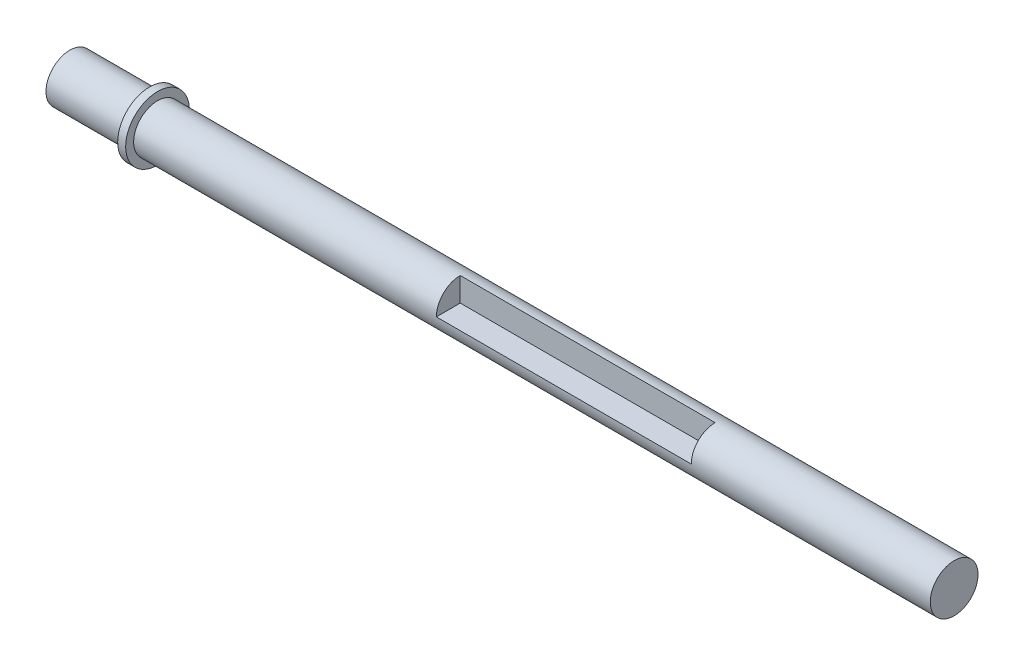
from build123d import *

# Parameters (mm, degrees)
ENL_V_MAT_EXTRU_1_DEPTH = 32


with BuildPart() as part:
    # Esquisse1 → Base-R_volution (revolve)
    with BuildSketch(Plane.XY, mode=Mode.PRIVATE) as base_r_volution_sk:
        Polygon((0, 0), (0, 3), (10, 3), (10, 4), (11, 4), (11, 3), (111, 3), (111, 0), align=None)
    revolve(base_r_volution_sk.sketch.rotate(Axis((0, 0, 0), (1, 0, 0)), 90), axis=Axis((0, 0, 0), (1, 0, 0)))

    # Esquisse2 → Enl_v. mat.-Extru.1 (cut)
    with BuildSketch(Plane(origin=(81, 0, 0), x_dir=(0, 0, -1), z_dir=(1, 0, 0))):
        with BuildLine():
            Line((0, 0), (0, 3))
            ThreePointArc((0, 3), (-2.121320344, 2.121320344), (-3, 0))
            Line((-3, 0), (0, 0))
        make_face()
    extrude(amount=-ENL_V_MAT_EXTRU_1_DEPTH, mode=Mode.SUBTRACT)


solid = part.part
